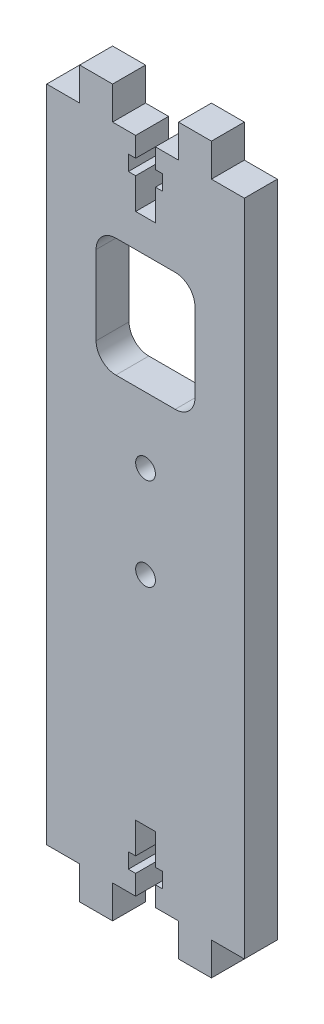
from build123d import *

# Parameters (mm, degrees)
ESQUISSE1_R        = 1.5
ESQUISSE1_W        = 15
ESQUISSE1_H        = 18
BOSS_EXTRU_1_DEPTH = 5
FILLET1_R          = 3


with BuildPart() as part:
    # Esquisse1 → Boss.-Extru.1 (new body)
    with BuildSketch(Plane.XY):
        Polygon((-10, 0), (-15, 0), (-15, 100), (-10, 100), (-10, 105), (-5, 105), (-5, 100), (-1.5, 100), (-1.5, 97), (-2.6, 97), (-2.6, 94.7), (-1.5, 94.7), (-1.5, 90), (1.5, 90), (1.5, 94.7), (2.6, 94.7), (2.6, 97), (1.5, 97), (1.5, 100), (5, 100), (5, 105), (10, 105), (10, 100), (15, 100), (15, 0), (10, 0), (10, -5), (5, -5), (5, 0), (1.5, 0), (1.5, 3), (2.6, 3), (2.6, 5.3), (1.5, 5.3), (1.5, 10), (-1.5, 10), (-1.5, 5.3), (-2.6, 5.3), (-2.6, 3), (-1.5, 3), (-1.5, 0), (-5, 0), (-5, -5), (-10, -5), align=None)
        with Locations((0, 57)):
            Circle(ESQUISSE1_R, mode=Mode.SUBTRACT)
        with Locations((0, 43)):
            Circle(ESQUISSE1_R, mode=Mode.SUBTRACT)
        with Locations((0, 76)):
            Rectangle(ESQUISSE1_W, ESQUISSE1_H, mode=Mode.SUBTRACT)
    extrude(amount=BOSS_EXTRU_1_DEPTH)

    # Fillet1
    fillet1_edges = [part.edges().sort_by_distance(p)[0] for p in [
        (-7.5, 85, 2.5),
        (-7.5, 67, 2.5),
        (7.5, 67, 2.5),
        (7.5, 85, 2.5),
    ]]
    fillet(fillet1_edges, radius=FILLET1_R)


solid = part.part
